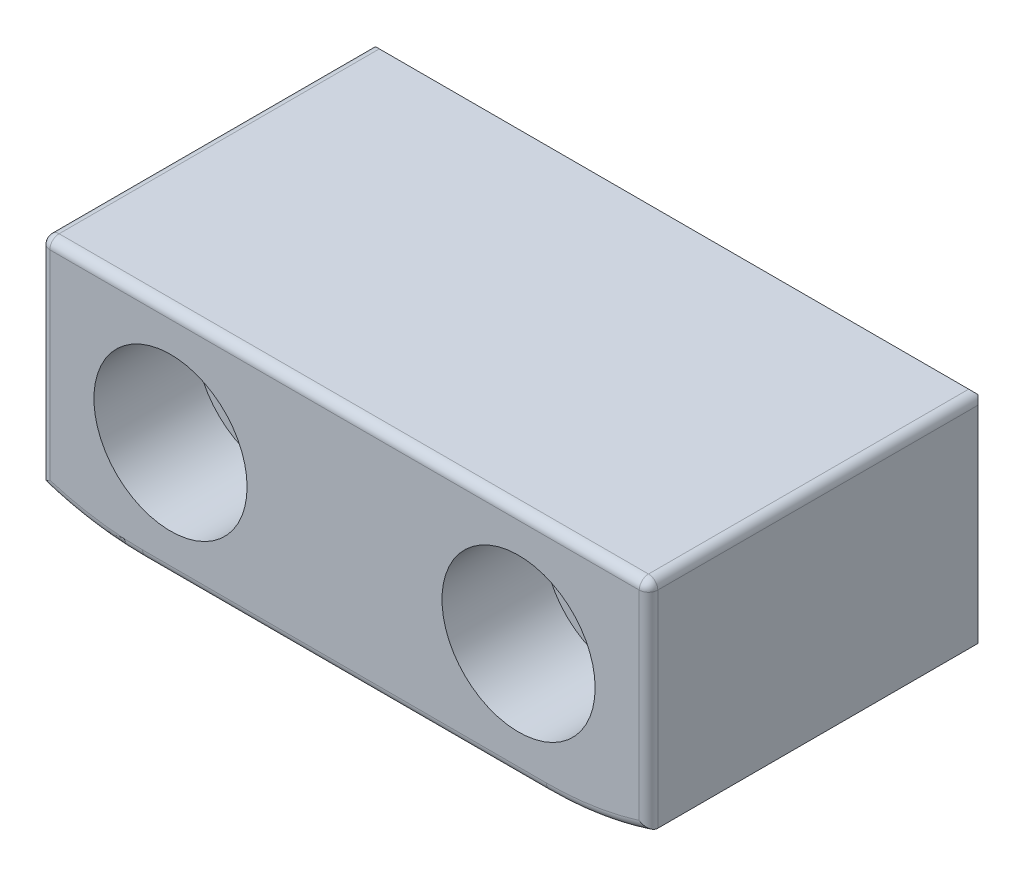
from build123d import *

# Parameters (mm, degrees)
BOSS_EXTRUDE1_DEPTH = 19.05
SKETCH3_R           = 2.794
CUT_EXTRUDE1_DEPTH  = 29.301630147
SKETCH4_R           = 4.191
CUT_EXTRUDE2_DEPTH  = 5.588
CHAMFER3_SIZE       = 1.016
FILLET3_R           = 0.508


with BuildPart() as part:
    # Sketch1 → Boss-Extrude1 (new body)
    with BuildSketch(Plane.XY):
        with BuildLine():
            Line((-11.049, -12.7), (11.049, -12.7))
            ThreePointArc((11.049, -12.7), (13.879081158, -12.473319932), (16.637, -11.799059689))
            Line((16.637, -11.799059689), (16.637, 0))
            Line((16.637, 0), (-16.637, 0))
            Line((-16.637, 0), (-16.637, -11.799059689))
            ThreePointArc((-16.637, -11.799059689), (-13.879081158, -12.473319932), (-11.049, -12.7))
        make_face()
    extrude(amount=-BOSS_EXTRUDE1_DEPTH)

    # Sketch3 → Cut-Extrude1 (cut, through all)
    with BuildSketch(Plane.XY):
        with Locations((9.525, -6.35)):
            Circle(SKETCH3_R)
        with Locations((-9.525, -6.35)):
            Circle(SKETCH3_R)
    extrude(amount=-CUT_EXTRUDE1_DEPTH, mode=Mode.SUBTRACT)

    # Sketch4 → Cut-Extrude2 (cut)
    with BuildSketch(Plane.XY):
        with Locations((9.525, -6.35)):
            Circle(SKETCH4_R)
        with Locations((-9.525, -6.35)):
            Circle(SKETCH4_R)
    extrude(amount=-CUT_EXTRUDE2_DEPTH, mode=Mode.SUBTRACT)

    # Chamfer3
    chamfer3_edges = [part.edges().sort_by_distance(p)[0] for p in [
        (13.879081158, -12.473319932, -19.05),
        (16.637, -5.899529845, -19.05),
        (0, 0, -19.05),
        (-16.637, -5.899529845, -19.05),
        (-13.879081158, -12.473319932, -19.05),
        (0, -12.7, -19.05),
    ]]
    chamfer(chamfer3_edges, length=CHAMFER3_SIZE)

    # Fillet3
    fillet3_edges = [part.edges().sort_by_distance(p)[0] for p in [
        (16.637, 0, -9.017),
        (-16.637, 0, -9.017),
        (-16.637, -5.899529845, 0),
        (0, 0, 0),
        (16.637, -5.899529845, 0),
        (13.879081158, -12.473319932, 0),
        (0, -12.7, 0),
        (-13.879081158, -12.473319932, 0),
    ]]
    fillet(fillet3_edges, radius=FILLET3_R)


solid = part.part
